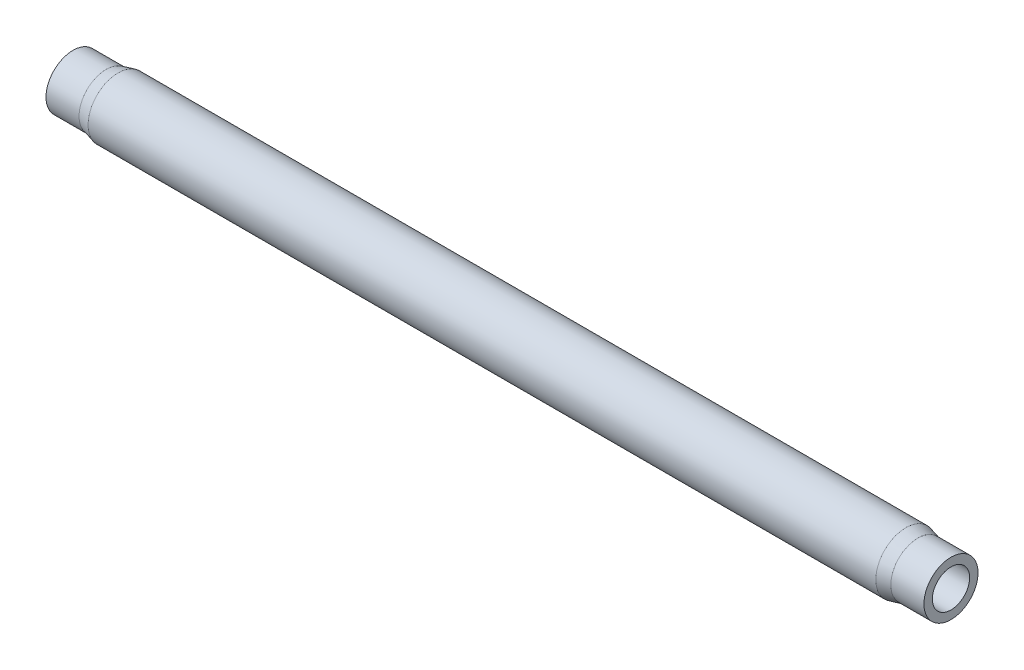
from build123d import *


with BuildPart() as part:
    # Esquisse1 → Base-R_volution (revolve)
    with BuildSketch(Plane.XY, mode=Mode.PRIVATE) as base_r_volution_sk:
        Polygon((0, 3.1), (0, 4.5), (5.5, 4.5), (7.5, 5), (138.5, 5), (140.5, 4.5), (146, 4.5), (146, 3.1), align=None)
    revolve(base_r_volution_sk.sketch.rotate(Axis((-10, 0, 0), (1, 0, 0)), 90), axis=Axis((-10, 0, 0), (1, 0, 0)))


solid = part.part
